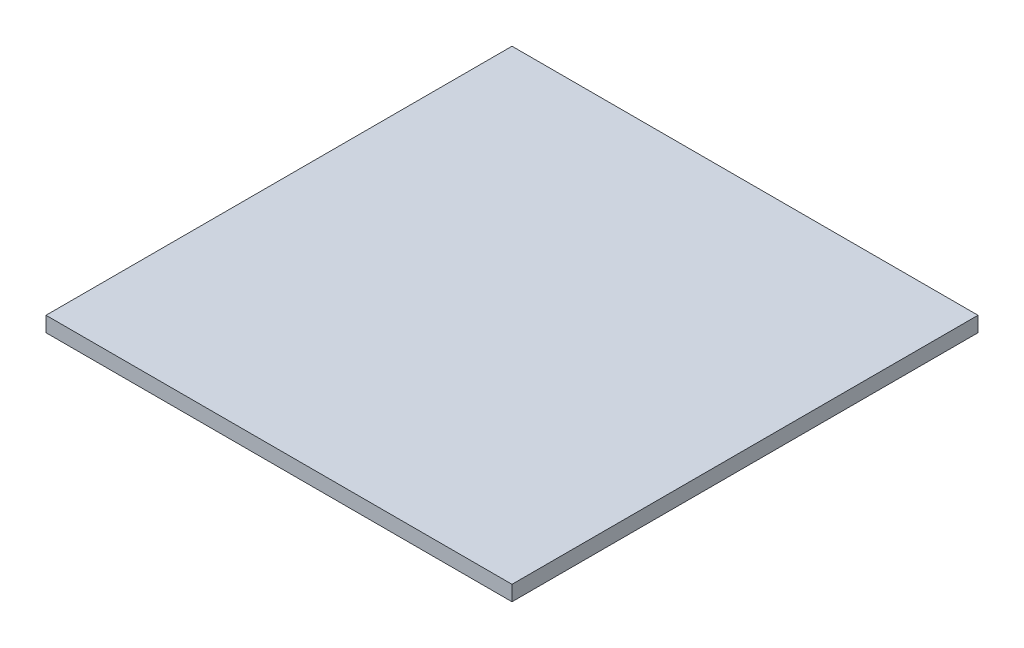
ISO-10303-21;
HEADER;
FILE_DESCRIPTION(('STEP AP214'),'2;1');
FILE_NAME('part.step','',(''),(''),'','','');
FILE_SCHEMA(('AUTOMOTIVE_DESIGN { 1 0 10303 214 1 1 1 1 }'));
ENDSEC;
DATA;
#1=APPLICATION_CONTEXT('core data for automotive mechanical design processes');
#2=APPLICATION_PROTOCOL_DEFINITION('international standard','automotive_design',2000,#1);
#3=PRODUCT_CONTEXT('',#1,'mechanical');
#4=PRODUCT('Part','Part','',(#3));
#5=PRODUCT_RELATED_PRODUCT_CATEGORY('part','',(#4));
#6=PRODUCT_DEFINITION_FORMATION('','',#4);
#7=PRODUCT_DEFINITION_CONTEXT('part definition',#1,'design');
#8=PRODUCT_DEFINITION('design','',#6,#7);
#9=PRODUCT_DEFINITION_SHAPE('','',#8);
#10=(LENGTH_UNIT() NAMED_UNIT(*) SI_UNIT(.MILLI.,.METRE.));
#11=(NAMED_UNIT(*) PLANE_ANGLE_UNIT() SI_UNIT($,.RADIAN.));
#12=(NAMED_UNIT(*) SI_UNIT($,.STERADIAN.) SOLID_ANGLE_UNIT());
#13=UNCERTAINTY_MEASURE_WITH_UNIT(LENGTH_MEASURE(1.E-05),#10,'distance_accuracy_value','');
#14=(GEOMETRIC_REPRESENTATION_CONTEXT(3) GLOBAL_UNCERTAINTY_ASSIGNED_CONTEXT((#13)) GLOBAL_UNIT_ASSIGNED_CONTEXT((#10,
#11,#12)) REPRESENTATION_CONTEXT('',''));
#15=CARTESIAN_POINT('',(0.,0.,0.));
#16=DIRECTION('',(0.,0.,1.));
#17=DIRECTION('',(1.,0.,0.));
#18=AXIS2_PLACEMENT_3D('',#15,#16,#17);
#19=CARTESIAN_POINT('',(-29.7580645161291,2.,-35.9385856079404));
#20=DIRECTION('',(1.,0.,0.));
#21=DIRECTION('',(0.,0.,-1.));
#22=AXIS2_PLACEMENT_3D('',#19,#20,#21);
#23=PLANE('',#22);
#24=DIRECTION('',(0.,0.,1.));
#25=VECTOR('',#24,1.);
#26=CARTESIAN_POINT('',(-29.7580645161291,0.,-35.9385856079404));
#27=LINE('',#26,#25);
#28=CARTESIAN_POINT('',(-29.7580645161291,0.,-35.9385856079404));
#29=VERTEX_POINT('',#28);
#30=CARTESIAN_POINT('',(-29.758064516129,0.,25.5614143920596));
#31=VERTEX_POINT('',#30);
#32=EDGE_CURVE('E98',#29,#31,#27,.T.);
#33=ORIENTED_EDGE('',*,*,#32,.T.);
#34=DIRECTION('',(0.,-1.,0.));
#35=VECTOR('',#34,1.);
#36=CARTESIAN_POINT('',(-29.758064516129,2.,25.5614143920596));
#37=LINE('',#36,#35);
#38=CARTESIAN_POINT('',(-29.758064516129,2.,25.5614143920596));
#39=VERTEX_POINT('',#38);
#40=EDGE_CURVE('E11',#39,#31,#37,.T.);
#41=ORIENTED_EDGE('',*,*,#40,.F.);
#42=DIRECTION('',(0.,0.,1.));
#43=VECTOR('',#42,1.);
#44=CARTESIAN_POINT('',(-29.7580645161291,2.,-35.9385856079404));
#45=LINE('',#44,#43);
#46=CARTESIAN_POINT('',(-29.7580645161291,2.,-35.9385856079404));
#47=VERTEX_POINT('',#46);
#48=EDGE_CURVE('E86',#47,#39,#45,.T.);
#49=ORIENTED_EDGE('',*,*,#48,.F.);
#50=DIRECTION('',(0.,-1.,0.));
#51=VECTOR('',#50,1.);
#52=CARTESIAN_POINT('',(-29.7580645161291,2.,-35.9385856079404));
#53=LINE('',#52,#51);
#54=EDGE_CURVE('E94',#47,#29,#53,.T.);
#55=ORIENTED_EDGE('',*,*,#54,.T.);
#56=EDGE_LOOP('',(#33,#41,#49,#55));
#57=FACE_BOUND('',#56,.T.);
#58=ADVANCED_FACE('F35',(#57),#23,.F.);
#59=CARTESIAN_POINT('',(-29.758064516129,2.,25.5614143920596));
#60=DIRECTION('',(0.,0.,-1.));
#61=DIRECTION('',(-1.,0.,0.));
#62=AXIS2_PLACEMENT_3D('',#59,#60,#61);
#63=PLANE('',#62);
#64=DIRECTION('',(1.,0.,0.));
#65=VECTOR('',#64,1.);
#66=CARTESIAN_POINT('',(-29.758064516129,0.,25.5614143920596));
#67=LINE('',#66,#65);
#68=CARTESIAN_POINT('',(31.741935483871,0.,25.5614143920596));
#69=VERTEX_POINT('',#68);
#70=EDGE_CURVE('E90',#31,#69,#67,.T.);
#71=ORIENTED_EDGE('',*,*,#70,.T.);
#72=DIRECTION('',(0.,-1.,0.));
#73=VECTOR('',#72,1.);
#74=CARTESIAN_POINT('',(31.741935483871,2.,25.5614143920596));
#75=LINE('',#74,#73);
#76=CARTESIAN_POINT('',(31.741935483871,2.,25.5614143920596));
#77=VERTEX_POINT('',#76);
#78=EDGE_CURVE('E43',#77,#69,#75,.T.);
#79=ORIENTED_EDGE('',*,*,#78,.F.);
#80=DIRECTION('',(1.,0.,0.));
#81=VECTOR('',#80,1.);
#82=CARTESIAN_POINT('',(-29.758064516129,2.,25.5614143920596));
#83=LINE('',#82,#81);
#84=EDGE_CURVE('E81',#39,#77,#83,.T.);
#85=ORIENTED_EDGE('',*,*,#84,.F.);
#86=ORIENTED_EDGE('',*,*,#40,.T.);
#87=EDGE_LOOP('',(#71,#79,#85,#86));
#88=FACE_BOUND('',#87,.T.);
#89=ADVANCED_FACE('F89',(#88),#63,.F.);
#90=CARTESIAN_POINT('',(31.7419354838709,2.,-35.9385856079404));
#91=DIRECTION('',(-1.,0.,0.));
#92=DIRECTION('',(0.,0.,1.));
#93=AXIS2_PLACEMENT_3D('',#90,#91,#92);
#94=PLANE('',#93);
#95=DIRECTION('',(0.,0.,-1.));
#96=VECTOR('',#95,1.);
#97=CARTESIAN_POINT('',(31.7419354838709,0.,-35.9385856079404));
#98=LINE('',#97,#96);
#99=CARTESIAN_POINT('',(31.7419354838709,0.,-35.9385856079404));
#100=VERTEX_POINT('',#99);
#101=EDGE_CURVE('E68',#69,#100,#98,.T.);
#102=ORIENTED_EDGE('',*,*,#101,.T.);
#103=DIRECTION('',(0.,-1.,0.));
#104=VECTOR('',#103,1.);
#105=CARTESIAN_POINT('',(31.7419354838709,2.,-35.9385856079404));
#106=LINE('',#105,#104);
#107=CARTESIAN_POINT('',(31.7419354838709,2.,-35.9385856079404));
#108=VERTEX_POINT('',#107);
#109=EDGE_CURVE('E91',#108,#100,#106,.T.);
#110=ORIENTED_EDGE('',*,*,#109,.F.);
#111=DIRECTION('',(0.,0.,-1.));
#112=VECTOR('',#111,1.);
#113=CARTESIAN_POINT('',(31.7419354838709,2.,-35.9385856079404));
#114=LINE('',#113,#112);
#115=EDGE_CURVE('E84',#77,#108,#114,.T.);
#116=ORIENTED_EDGE('',*,*,#115,.F.);
#117=ORIENTED_EDGE('',*,*,#78,.T.);
#118=EDGE_LOOP('',(#102,#110,#116,#117));
#119=FACE_BOUND('',#118,.T.);
#120=ADVANCED_FACE('F92',(#119),#94,.F.);
#121=CARTESIAN_POINT('',(-29.7580645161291,2.,-35.9385856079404));
#122=DIRECTION('',(0.,0.,1.));
#123=DIRECTION('',(1.,0.,0.));
#124=AXIS2_PLACEMENT_3D('',#121,#122,#123);
#125=PLANE('',#124);
#126=DIRECTION('',(-1.,0.,0.));
#127=VECTOR('',#126,1.);
#128=CARTESIAN_POINT('',(-29.7580645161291,0.,-35.9385856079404));
#129=LINE('',#128,#127);
#130=EDGE_CURVE('E74',#100,#29,#129,.T.);
#131=ORIENTED_EDGE('',*,*,#130,.T.);
#132=ORIENTED_EDGE('',*,*,#54,.F.);
#133=DIRECTION('',(-1.,0.,0.));
#134=VECTOR('',#133,1.);
#135=CARTESIAN_POINT('',(-29.7580645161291,2.,-35.9385856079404));
#136=LINE('',#135,#134);
#137=EDGE_CURVE('E51',#108,#47,#136,.T.);
#138=ORIENTED_EDGE('',*,*,#137,.F.);
#139=ORIENTED_EDGE('',*,*,#109,.T.);
#140=EDGE_LOOP('',(#131,#132,#138,#139));
#141=FACE_BOUND('',#140,.T.);
#142=ADVANCED_FACE('F105',(#141),#125,.F.);
#143=CARTESIAN_POINT('',(0.,2.,0.));
#144=DIRECTION('',(0.,1.,0.));
#145=DIRECTION('',(0.,0.,1.));
#146=AXIS2_PLACEMENT_3D('',#143,#144,#145);
#147=PLANE('',#146);
#148=ORIENTED_EDGE('',*,*,#48,.T.);
#149=ORIENTED_EDGE('',*,*,#84,.T.);
#150=ORIENTED_EDGE('',*,*,#115,.T.);
#151=ORIENTED_EDGE('',*,*,#137,.T.);
#152=EDGE_LOOP('',(#148,#149,#150,#151));
#153=FACE_BOUND('',#152,.T.);
#154=ADVANCED_FACE('F82',(#153),#147,.T.);
#155=CARTESIAN_POINT('',(0.,0.,0.));
#156=DIRECTION('',(0.,1.,0.));
#157=DIRECTION('',(0.,0.,1.));
#158=AXIS2_PLACEMENT_3D('',#155,#156,#157);
#159=PLANE('',#158);
#160=ORIENTED_EDGE('',*,*,#32,.F.);
#161=ORIENTED_EDGE('',*,*,#130,.F.);
#162=ORIENTED_EDGE('',*,*,#101,.F.);
#163=ORIENTED_EDGE('',*,*,#70,.F.);
#164=EDGE_LOOP('',(#160,#161,#162,#163));
#165=FACE_BOUND('',#164,.T.);
#166=ADVANCED_FACE('F108',(#165),#159,.F.);
#167=CLOSED_SHELL('',(#58,#89,#120,#142,#154,#166));
#168=MANIFOLD_SOLID_BREP('B2',#167);
#169=ADVANCED_BREP_SHAPE_REPRESENTATION('',(#18,#168),#14);
#170=SHAPE_DEFINITION_REPRESENTATION(#9,#169);
ENDSEC;
END-ISO-10303-21;
